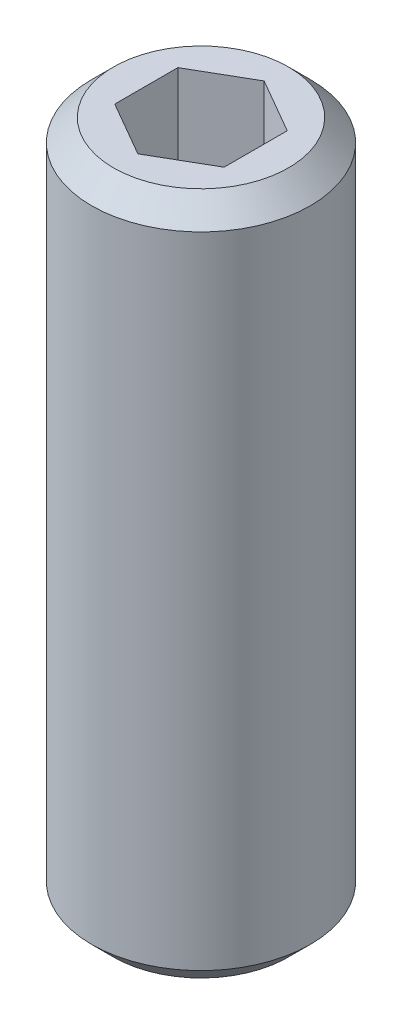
ISO-10303-21;
HEADER;
FILE_DESCRIPTION(('STEP AP214'),'2;1');
FILE_NAME('part.step','',(''),(''),'','','');
FILE_SCHEMA(('AUTOMOTIVE_DESIGN { 1 0 10303 214 1 1 1 1 }'));
ENDSEC;
DATA;
#1=APPLICATION_CONTEXT('core data for automotive mechanical design processes');
#2=APPLICATION_PROTOCOL_DEFINITION('international standard','automotive_design',2000,#1);
#3=PRODUCT_CONTEXT('',#1,'mechanical');
#4=PRODUCT('Part','Part','',(#3));
#5=PRODUCT_RELATED_PRODUCT_CATEGORY('part','',(#4));
#6=PRODUCT_DEFINITION_FORMATION('','',#4);
#7=PRODUCT_DEFINITION_CONTEXT('part definition',#1,'design');
#8=PRODUCT_DEFINITION('design','',#6,#7);
#9=PRODUCT_DEFINITION_SHAPE('','',#8);
#10=(LENGTH_UNIT() NAMED_UNIT(*) SI_UNIT(.MILLI.,.METRE.));
#11=(NAMED_UNIT(*) PLANE_ANGLE_UNIT() SI_UNIT($,.RADIAN.));
#12=(NAMED_UNIT(*) SI_UNIT($,.STERADIAN.) SOLID_ANGLE_UNIT());
#13=UNCERTAINTY_MEASURE_WITH_UNIT(LENGTH_MEASURE(1.E-05),#10,'distance_accuracy_value','');
#14=(GEOMETRIC_REPRESENTATION_CONTEXT(3) GLOBAL_UNCERTAINTY_ASSIGNED_CONTEXT((#13)) GLOBAL_UNIT_ASSIGNED_CONTEXT((#10,
#11,#12)) REPRESENTATION_CONTEXT('',''));
#15=CARTESIAN_POINT('',(0.,0.,0.));
#16=DIRECTION('',(0.,0.,1.));
#17=DIRECTION('',(1.,0.,0.));
#18=AXIS2_PLACEMENT_3D('',#15,#16,#17);
#19=CARTESIAN_POINT('',(0.,-25.,0.));
#20=DIRECTION('',(0.,1.,0.));
#21=DIRECTION('',(0.,0.,1.));
#22=AXIS2_PLACEMENT_3D('',#19,#20,#21);
#23=PLANE('',#22);
#24=CARTESIAN_POINT('',(0.,-25.,0.));
#25=DIRECTION('',(0.,1.,0.));
#26=DIRECTION('',(0.,0.,1.));
#27=AXIS2_PLACEMENT_3D('',#24,#25,#26);
#28=CIRCLE('',#27,3.2);
#29=CARTESIAN_POINT('',(0.,-25.,3.2));
#30=VERTEX_POINT('',#29);
#31=EDGE_CURVE('E139',#30,#30,#28,.F.);
#32=ORIENTED_EDGE('',*,*,#31,.T.);
#33=EDGE_LOOP('',(#32));
#34=FACE_BOUND('',#33,.T.);
#35=ADVANCED_FACE('F28',(#34),#23,.F.);
#36=CARTESIAN_POINT('',(0.,0.,0.));
#37=DIRECTION('',(0.,1.,0.));
#38=DIRECTION('',(0.,0.,1.));
#39=AXIS2_PLACEMENT_3D('',#36,#37,#38);
#40=CYLINDRICAL_SURFACE('',#39,4.);
#41=CARTESIAN_POINT('',(0.,-0.800000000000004,0.));
#42=DIRECTION('',(0.,-1.,0.));
#43=DIRECTION('',(0.,0.,-1.));
#44=AXIS2_PLACEMENT_3D('',#41,#42,#43);
#45=CIRCLE('',#44,4.);
#46=CARTESIAN_POINT('',(0.,-0.800000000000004,-4.));
#47=VERTEX_POINT('',#46);
#48=EDGE_CURVE('E11',#47,#47,#45,.T.);
#49=ORIENTED_EDGE('',*,*,#48,.T.);
#50=EDGE_LOOP('',(#49));
#51=FACE_BOUND('',#50,.T.);
#52=CARTESIAN_POINT('',(0.,-24.2,0.));
#53=DIRECTION('',(0.,1.,0.));
#54=DIRECTION('',(0.,0.,1.));
#55=AXIS2_PLACEMENT_3D('',#52,#53,#54);
#56=CIRCLE('',#55,4.);
#57=CARTESIAN_POINT('',(0.,-24.2,4.));
#58=VERTEX_POINT('',#57);
#59=EDGE_CURVE('E130',#58,#58,#56,.T.);
#60=ORIENTED_EDGE('',*,*,#59,.T.);
#61=EDGE_LOOP('',(#60));
#62=FACE_BOUND('',#61,.T.);
#63=ADVANCED_FACE('F160',(#51,#62),#40,.T.);
#64=CARTESIAN_POINT('',(0.,0.,0.));
#65=DIRECTION('',(0.,-1.,0.));
#66=DIRECTION('',(0.,0.,-1.));
#67=AXIS2_PLACEMENT_3D('',#64,#65,#66);
#68=PLANE('',#67);
#69=DIRECTION('',(0.866025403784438,0.,-0.500000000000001));
#70=VECTOR('',#69,1.);
#71=CARTESIAN_POINT('',(0.,0.,2.3094010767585));
#72=LINE('',#71,#70);
#73=CARTESIAN_POINT('',(0.,0.,2.3094010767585));
#74=VERTEX_POINT('',#73);
#75=CARTESIAN_POINT('',(2.,0.,1.15470053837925));
#76=VERTEX_POINT('',#75);
#77=EDGE_CURVE('E96',#74,#76,#72,.T.);
#78=ORIENTED_EDGE('',*,*,#77,.F.);
#79=DIRECTION('',(0.866025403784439,0.,0.5));
#80=VECTOR('',#79,1.);
#81=CARTESIAN_POINT('',(-2.,0.,1.15470053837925));
#82=LINE('',#81,#80);
#83=CARTESIAN_POINT('',(-2.,0.,1.15470053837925));
#84=VERTEX_POINT('',#83);
#85=EDGE_CURVE('E42',#84,#74,#82,.T.);
#86=ORIENTED_EDGE('',*,*,#85,.F.);
#87=DIRECTION('',(0.,0.,1.));
#88=VECTOR('',#87,1.);
#89=CARTESIAN_POINT('',(-2.,0.,-1.15470053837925));
#90=LINE('',#89,#88);
#91=CARTESIAN_POINT('',(-2.,0.,-1.15470053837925));
#92=VERTEX_POINT('',#91);
#93=EDGE_CURVE('E112',#92,#84,#90,.T.);
#94=ORIENTED_EDGE('',*,*,#93,.F.);
#95=DIRECTION('',(-0.866025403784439,0.,0.5));
#96=VECTOR('',#95,1.);
#97=CARTESIAN_POINT('',(0.,0.,-2.3094010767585));
#98=LINE('',#97,#96);
#99=CARTESIAN_POINT('',(0.,0.,-2.3094010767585));
#100=VERTEX_POINT('',#99);
#101=EDGE_CURVE('E106',#100,#92,#98,.T.);
#102=ORIENTED_EDGE('',*,*,#101,.F.);
#103=DIRECTION('',(-0.866025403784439,0.,-0.499999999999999));
#104=VECTOR('',#103,1.);
#105=CARTESIAN_POINT('',(2.,0.,-1.15470053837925));
#106=LINE('',#105,#104);
#107=CARTESIAN_POINT('',(2.,0.,-1.15470053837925));
#108=VERTEX_POINT('',#107);
#109=EDGE_CURVE('E104',#108,#100,#106,.T.);
#110=ORIENTED_EDGE('',*,*,#109,.F.);
#111=DIRECTION('',(0.,0.,-1.));
#112=VECTOR('',#111,1.);
#113=CARTESIAN_POINT('',(2.,0.,1.15470053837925));
#114=LINE('',#113,#112);
#115=EDGE_CURVE('E85',#76,#108,#114,.T.);
#116=ORIENTED_EDGE('',*,*,#115,.F.);
#117=EDGE_LOOP('',(#78,#86,#94,#102,#110,#116));
#118=FACE_BOUND('',#117,.T.);
#119=CARTESIAN_POINT('',(0.,0.,0.));
#120=DIRECTION('',(0.,-1.,0.));
#121=DIRECTION('',(0.,0.,-1.));
#122=AXIS2_PLACEMENT_3D('',#119,#120,#121);
#123=CIRCLE('',#122,3.2);
#124=CARTESIAN_POINT('',(0.,0.,-3.2));
#125=VERTEX_POINT('',#124);
#126=EDGE_CURVE('E35',#125,#125,#123,.F.);
#127=ORIENTED_EDGE('',*,*,#126,.T.);
#128=EDGE_LOOP('',(#127));
#129=FACE_BOUND('',#128,.T.);
#130=ADVANCED_FACE('F100',(#118,#129),#68,.F.);
#131=CARTESIAN_POINT('',(0.,-24.2,0.));
#132=DIRECTION('',(0.,1.,0.));
#133=DIRECTION('',(0.,0.,1.));
#134=AXIS2_PLACEMENT_3D('',#131,#132,#133);
#135=CONICAL_SURFACE('',#134,4.,0.785398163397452);
#136=ORIENTED_EDGE('',*,*,#31,.F.);
#137=EDGE_LOOP('',(#136));
#138=FACE_BOUND('',#137,.T.);
#139=ORIENTED_EDGE('',*,*,#59,.F.);
#140=EDGE_LOOP('',(#139));
#141=FACE_BOUND('',#140,.T.);
#142=ADVANCED_FACE('F147',(#138,#141),#135,.T.);
#143=CARTESIAN_POINT('',(0.,0.,0.));
#144=DIRECTION('',(0.,-1.,0.));
#145=DIRECTION('',(0.,0.,-1.));
#146=AXIS2_PLACEMENT_3D('',#143,#144,#145);
#147=CONICAL_SURFACE('',#146,3.2,0.785398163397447);
#148=CARTESIAN_POINT('',(0.,-0.800000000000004,-4.));
#149=CARTESIAN_POINT('',(0.,-0.791666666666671,-3.99166666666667));
#150=CARTESIAN_POINT('',(0.,-0.783333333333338,-3.98333333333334));
#151=CARTESIAN_POINT('',(0.,-0.766666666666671,-3.96666666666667));
#152=CARTESIAN_POINT('',(0.,-0.758333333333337,-3.95833333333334));
#153=CARTESIAN_POINT('',(0.,-0.741666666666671,-3.94166666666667));
#154=CARTESIAN_POINT('',(0.,-0.733333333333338,-3.93333333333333));
#155=CARTESIAN_POINT('',(0.,-0.716666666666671,-3.91666666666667));
#156=CARTESIAN_POINT('',(0.,-0.708333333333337,-3.90833333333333));
#157=CARTESIAN_POINT('',(0.,-0.69166666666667,-3.89166666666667));
#158=CARTESIAN_POINT('',(0.,-0.683333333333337,-3.88333333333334));
#159=CARTESIAN_POINT('',(0.,-0.66666666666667,-3.86666666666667));
#160=CARTESIAN_POINT('',(0.,-0.658333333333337,-3.85833333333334));
#161=CARTESIAN_POINT('',(0.,-0.64166666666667,-3.84166666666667));
#162=CARTESIAN_POINT('',(0.,-0.633333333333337,-3.83333333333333));
#163=CARTESIAN_POINT('',(0.,-0.61666666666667,-3.81666666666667));
#164=CARTESIAN_POINT('',(0.,-0.608333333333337,-3.80833333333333));
#165=CARTESIAN_POINT('',(0.,-0.59166666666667,-3.79166666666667));
#166=CARTESIAN_POINT('',(0.,-0.583333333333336,-3.78333333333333));
#167=CARTESIAN_POINT('',(0.,-0.56666666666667,-3.76666666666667));
#168=CARTESIAN_POINT('',(0.,-0.558333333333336,-3.75833333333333));
#169=CARTESIAN_POINT('',(0.,-0.54166666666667,-3.74166666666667));
#170=CARTESIAN_POINT('',(0.,-0.533333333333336,-3.73333333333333));
#171=CARTESIAN_POINT('',(0.,-0.516666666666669,-3.71666666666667));
#172=CARTESIAN_POINT('',(0.,-0.508333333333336,-3.70833333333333));
#173=CARTESIAN_POINT('',(0.,-0.491666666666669,-3.69166666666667));
#174=CARTESIAN_POINT('',(0.,-0.483333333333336,-3.68333333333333));
#175=CARTESIAN_POINT('',(0.,-0.466666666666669,-3.66666666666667));
#176=CARTESIAN_POINT('',(0.,-0.458333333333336,-3.65833333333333));
#177=CARTESIAN_POINT('',(0.,-0.441666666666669,-3.64166666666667));
#178=CARTESIAN_POINT('',(0.,-0.433333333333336,-3.63333333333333));
#179=CARTESIAN_POINT('',(0.,-0.416666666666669,-3.61666666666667));
#180=CARTESIAN_POINT('',(0.,-0.408333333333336,-3.60833333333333));
#181=CARTESIAN_POINT('',(0.,-0.391666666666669,-3.59166666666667));
#182=CARTESIAN_POINT('',(0.,-0.383333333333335,-3.58333333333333));
#183=CARTESIAN_POINT('',(0.,-0.366666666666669,-3.56666666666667));
#184=CARTESIAN_POINT('',(0.,-0.358333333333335,-3.55833333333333));
#185=CARTESIAN_POINT('',(0.,-0.341666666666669,-3.54166666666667));
#186=CARTESIAN_POINT('',(0.,-0.333333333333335,-3.53333333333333));
#187=CARTESIAN_POINT('',(0.,-0.316666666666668,-3.51666666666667));
#188=CARTESIAN_POINT('',(0.,-0.308333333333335,-3.50833333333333));
#189=CARTESIAN_POINT('',(0.,-0.291666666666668,-3.49166666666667));
#190=CARTESIAN_POINT('',(0.,-0.283333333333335,-3.48333333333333));
#191=CARTESIAN_POINT('',(0.,-0.266666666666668,-3.46666666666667));
#192=CARTESIAN_POINT('',(0.,-0.258333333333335,-3.45833333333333));
#193=CARTESIAN_POINT('',(0.,-0.241666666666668,-3.44166666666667));
#194=CARTESIAN_POINT('',(0.,-0.233333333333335,-3.43333333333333));
#195=CARTESIAN_POINT('',(0.,-0.216666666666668,-3.41666666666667));
#196=CARTESIAN_POINT('',(0.,-0.208333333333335,-3.40833333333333));
#197=CARTESIAN_POINT('',(0.,-0.191666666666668,-3.39166666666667));
#198=CARTESIAN_POINT('',(0.,-0.183333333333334,-3.38333333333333));
#199=CARTESIAN_POINT('',(0.,-0.166666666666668,-3.36666666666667));
#200=CARTESIAN_POINT('',(0.,-0.158333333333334,-3.35833333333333));
#201=CARTESIAN_POINT('',(0.,-0.141666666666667,-3.34166666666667));
#202=CARTESIAN_POINT('',(0.,-0.133333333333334,-3.33333333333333));
#203=CARTESIAN_POINT('',(0.,-0.116666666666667,-3.31666666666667));
#204=CARTESIAN_POINT('',(0.,-0.108333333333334,-3.30833333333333));
#205=CARTESIAN_POINT('',(0.,-0.0916666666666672,-3.29166666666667));
#206=CARTESIAN_POINT('',(0.,-0.0833333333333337,-3.28333333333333));
#207=CARTESIAN_POINT('',(0.,-0.066666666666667,-3.26666666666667));
#208=CARTESIAN_POINT('',(0.,-0.0583333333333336,-3.25833333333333));
#209=CARTESIAN_POINT('',(0.,-0.0416666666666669,-3.24166666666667));
#210=CARTESIAN_POINT('',(0.,-0.0333333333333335,-3.23333333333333));
#211=CARTESIAN_POINT('',(0.,-0.0166666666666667,-3.21666666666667));
#212=CARTESIAN_POINT('',(0.,-0.0083333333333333,-3.20833333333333));
#213=CARTESIAN_POINT('',(0.,0.,-3.2));
#214=B_SPLINE_CURVE_WITH_KNOTS('',3,(#148,#149,#150,#151,#152,#153,#154,#155,#156,#157,#158,
#159,#160,#161,#162,#163,#164,#165,#166,#167,#168,#169,#170,#171,#172,#173,#174,#175,#176,#177,
#178,#179,#180,#181,#182,#183,#184,#185,#186,#187,#188,#189,#190,#191,#192,#193,#194,#195,#196,
#197,#198,#199,#200,#201,#202,#203,#204,#205,#206,#207,#208,#209,#210,#211,#212,#213),
.UNSPECIFIED.,.F.,.F.,(4,2,2,2,2,2,2,2,2,2,2,2,2,2,2,2,2,2,2,2,2,2,2,2,2,2,2,2,2,2,2,2,4),(0.,
0.0353553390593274,0.0707106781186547,0.106066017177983,0.14142135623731,0.176776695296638,
0.212132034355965,0.247487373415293,0.28284271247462,0.318198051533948,0.353553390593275,
0.388908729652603,0.42426406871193,0.459619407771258,0.494974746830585,0.530330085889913,
0.56568542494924,0.601040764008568,0.636396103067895,0.671751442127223,0.70710678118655,
0.742462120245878,0.777817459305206,0.813172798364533,0.848528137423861,0.883883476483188,
0.919238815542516,0.954594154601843,0.98994949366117,1.0253048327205,1.06066017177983,
1.09601551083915,1.13137084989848),.UNSPECIFIED.);
#215=EDGE_CURVE('BSEAM144',#47,#125,#214,.T.);
#216=ORIENTED_EDGE('',*,*,#48,.F.);
#217=ORIENTED_EDGE('',*,*,#126,.F.);
#218=ORIENTED_EDGE('',*,*,#215,.T.);
#219=ORIENTED_EDGE('',*,*,#215,.F.);
#220=EDGE_LOOP('',(#216,#218,#217,#219));
#221=FACE_BOUND('',#220,.T.);
#222=ADVANCED_FACE('F144',(#221),#147,.T.);
#223=CARTESIAN_POINT('',(-2.,-5.,1.15470053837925));
#224=DIRECTION('',(-0.5,0.,0.866025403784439));
#225=DIRECTION('',(0.866025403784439,0.,0.5));
#226=AXIS2_PLACEMENT_3D('',#223,#224,#225);
#227=PLANE('',#226);
#228=ORIENTED_EDGE('',*,*,#85,.T.);
#229=DIRECTION('',(0.,1.,0.));
#230=VECTOR('',#229,1.);
#231=CARTESIAN_POINT('',(0.,-5.,2.3094010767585));
#232=LINE('',#231,#230);
#233=CARTESIAN_POINT('',(0.,-5.,2.3094010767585));
#234=VERTEX_POINT('',#233);
#235=EDGE_CURVE('E93',#234,#74,#232,.T.);
#236=ORIENTED_EDGE('',*,*,#235,.F.);
#237=DIRECTION('',(0.866025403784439,0.,0.5));
#238=VECTOR('',#237,1.);
#239=CARTESIAN_POINT('',(-2.,-5.,1.15470053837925));
#240=LINE('',#239,#238);
#241=CARTESIAN_POINT('',(-2.,-5.,1.15470053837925));
#242=VERTEX_POINT('',#241);
#243=EDGE_CURVE('E114',#242,#234,#240,.T.);
#244=ORIENTED_EDGE('',*,*,#243,.F.);
#245=DIRECTION('',(0.,1.,0.));
#246=VECTOR('',#245,1.);
#247=CARTESIAN_POINT('',(-2.,-5.,1.15470053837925));
#248=LINE('',#247,#246);
#249=EDGE_CURVE('E49',#242,#84,#248,.T.);
#250=ORIENTED_EDGE('',*,*,#249,.T.);
#251=EDGE_LOOP('',(#228,#236,#244,#250));
#252=FACE_BOUND('',#251,.T.);
#253=ADVANCED_FACE('F146',(#252),#227,.F.);
#254=CARTESIAN_POINT('',(-2.,-5.,-1.15470053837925));
#255=DIRECTION('',(-1.,0.,0.));
#256=DIRECTION('',(0.,0.,1.));
#257=AXIS2_PLACEMENT_3D('',#254,#255,#256);
#258=PLANE('',#257);
#259=ORIENTED_EDGE('',*,*,#93,.T.);
#260=ORIENTED_EDGE('',*,*,#249,.F.);
#261=DIRECTION('',(0.,0.,1.));
#262=VECTOR('',#261,1.);
#263=CARTESIAN_POINT('',(-2.,-5.,-1.15470053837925));
#264=LINE('',#263,#262);
#265=CARTESIAN_POINT('',(-2.,-5.,-1.15470053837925));
#266=VERTEX_POINT('',#265);
#267=EDGE_CURVE('E126',#266,#242,#264,.T.);
#268=ORIENTED_EDGE('',*,*,#267,.F.);
#269=DIRECTION('',(0.,1.,0.));
#270=VECTOR('',#269,1.);
#271=CARTESIAN_POINT('',(-2.,-5.,-1.15470053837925));
#272=LINE('',#271,#270);
#273=EDGE_CURVE('E131',#266,#92,#272,.T.);
#274=ORIENTED_EDGE('',*,*,#273,.T.);
#275=EDGE_LOOP('',(#259,#260,#268,#274));
#276=FACE_BOUND('',#275,.T.);
#277=ADVANCED_FACE('F154',(#276),#258,.F.);
#278=CARTESIAN_POINT('',(0.,-5.,-2.3094010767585));
#279=DIRECTION('',(-0.5,0.,-0.866025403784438));
#280=DIRECTION('',(-0.866025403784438,0.,0.5));
#281=AXIS2_PLACEMENT_3D('',#278,#279,#280);
#282=PLANE('',#281);
#283=ORIENTED_EDGE('',*,*,#101,.T.);
#284=ORIENTED_EDGE('',*,*,#273,.F.);
#285=DIRECTION('',(-0.866025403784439,0.,0.5));
#286=VECTOR('',#285,1.);
#287=CARTESIAN_POINT('',(0.,-5.,-2.3094010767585));
#288=LINE('',#287,#286);
#289=CARTESIAN_POINT('',(0.,-5.,-2.3094010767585));
#290=VERTEX_POINT('',#289);
#291=EDGE_CURVE('E123',#290,#266,#288,.T.);
#292=ORIENTED_EDGE('',*,*,#291,.F.);
#293=DIRECTION('',(0.,1.,0.));
#294=VECTOR('',#293,1.);
#295=CARTESIAN_POINT('',(0.,-5.,-2.3094010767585));
#296=LINE('',#295,#294);
#297=EDGE_CURVE('E133',#290,#100,#296,.T.);
#298=ORIENTED_EDGE('',*,*,#297,.T.);
#299=EDGE_LOOP('',(#283,#284,#292,#298));
#300=FACE_BOUND('',#299,.T.);
#301=ADVANCED_FACE('F199',(#300),#282,.F.);
#302=CARTESIAN_POINT('',(2.,-5.,-1.15470053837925));
#303=DIRECTION('',(0.5,0.,-0.866025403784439));
#304=DIRECTION('',(-0.866025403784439,0.,-0.5));
#305=AXIS2_PLACEMENT_3D('',#302,#303,#304);
#306=PLANE('',#305);
#307=ORIENTED_EDGE('',*,*,#109,.T.);
#308=ORIENTED_EDGE('',*,*,#297,.F.);
#309=DIRECTION('',(-0.866025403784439,0.,-0.499999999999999));
#310=VECTOR('',#309,1.);
#311=CARTESIAN_POINT('',(2.,-5.,-1.15470053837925));
#312=LINE('',#311,#310);
#313=CARTESIAN_POINT('',(2.,-5.,-1.15470053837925));
#314=VERTEX_POINT('',#313);
#315=EDGE_CURVE('E120',#314,#290,#312,.T.);
#316=ORIENTED_EDGE('',*,*,#315,.F.);
#317=DIRECTION('',(0.,1.,0.));
#318=VECTOR('',#317,1.);
#319=CARTESIAN_POINT('',(2.,-5.,-1.15470053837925));
#320=LINE('',#319,#318);
#321=EDGE_CURVE('E92',#314,#108,#320,.T.);
#322=ORIENTED_EDGE('',*,*,#321,.T.);
#323=EDGE_LOOP('',(#307,#308,#316,#322));
#324=FACE_BOUND('',#323,.T.);
#325=ADVANCED_FACE('F208',(#324),#306,.F.);
#326=CARTESIAN_POINT('',(2.,-5.,1.15470053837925));
#327=DIRECTION('',(1.,0.,0.));
#328=DIRECTION('',(0.,0.,-1.));
#329=AXIS2_PLACEMENT_3D('',#326,#327,#328);
#330=PLANE('',#329);
#331=ORIENTED_EDGE('',*,*,#115,.T.);
#332=ORIENTED_EDGE('',*,*,#321,.F.);
#333=DIRECTION('',(0.,0.,-1.));
#334=VECTOR('',#333,1.);
#335=CARTESIAN_POINT('',(2.,-5.,1.15470053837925));
#336=LINE('',#335,#334);
#337=CARTESIAN_POINT('',(2.,-5.,1.15470053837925));
#338=VERTEX_POINT('',#337);
#339=EDGE_CURVE('E88',#338,#314,#336,.T.);
#340=ORIENTED_EDGE('',*,*,#339,.F.);
#341=DIRECTION('',(0.,1.,0.));
#342=VECTOR('',#341,1.);
#343=CARTESIAN_POINT('',(2.,-5.,1.15470053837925));
#344=LINE('',#343,#342);
#345=EDGE_CURVE('E81',#338,#76,#344,.T.);
#346=ORIENTED_EDGE('',*,*,#345,.T.);
#347=EDGE_LOOP('',(#331,#332,#340,#346));
#348=FACE_BOUND('',#347,.T.);
#349=ADVANCED_FACE('F83',(#348),#330,.F.);
#350=CARTESIAN_POINT('',(0.,-5.,2.3094010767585));
#351=DIRECTION('',(0.500000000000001,0.,0.866025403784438));
#352=DIRECTION('',(0.866025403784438,0.,-0.500000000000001));
#353=AXIS2_PLACEMENT_3D('',#350,#351,#352);
#354=PLANE('',#353);
#355=ORIENTED_EDGE('',*,*,#77,.T.);
#356=ORIENTED_EDGE('',*,*,#345,.F.);
#357=DIRECTION('',(0.866025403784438,0.,-0.500000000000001));
#358=VECTOR('',#357,1.);
#359=CARTESIAN_POINT('',(0.,-5.,2.3094010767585));
#360=LINE('',#359,#358);
#361=EDGE_CURVE('E117',#234,#338,#360,.T.);
#362=ORIENTED_EDGE('',*,*,#361,.F.);
#363=ORIENTED_EDGE('',*,*,#235,.T.);
#364=EDGE_LOOP('',(#355,#356,#362,#363));
#365=FACE_BOUND('',#364,.T.);
#366=ADVANCED_FACE('F97',(#365),#354,.F.);
#367=CARTESIAN_POINT('',(2.,-5.,3.46410161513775));
#368=DIRECTION('',(0.,1.,0.));
#369=DIRECTION('',(0.,0.,1.));
#370=AXIS2_PLACEMENT_3D('',#367,#368,#369);
#371=PLANE('',#370);
#372=ORIENTED_EDGE('',*,*,#243,.T.);
#373=ORIENTED_EDGE('',*,*,#361,.T.);
#374=ORIENTED_EDGE('',*,*,#339,.T.);
#375=ORIENTED_EDGE('',*,*,#315,.T.);
#376=ORIENTED_EDGE('',*,*,#291,.T.);
#377=ORIENTED_EDGE('',*,*,#267,.T.);
#378=EDGE_LOOP('',(#372,#373,#374,#375,#376,#377));
#379=FACE_BOUND('',#378,.T.);
#380=ADVANCED_FACE('F235',(#379),#371,.T.);
#381=CLOSED_SHELL('',(#35,#63,#130,#142,#222,#253,#277,#301,#325,#349,#366,#380));
#382=MANIFOLD_SOLID_BREP('B2',#381);
#383=ADVANCED_BREP_SHAPE_REPRESENTATION('',(#18,#382),#14);
#384=SHAPE_DEFINITION_REPRESENTATION(#9,#383);
ENDSEC;
END-ISO-10303-21;
